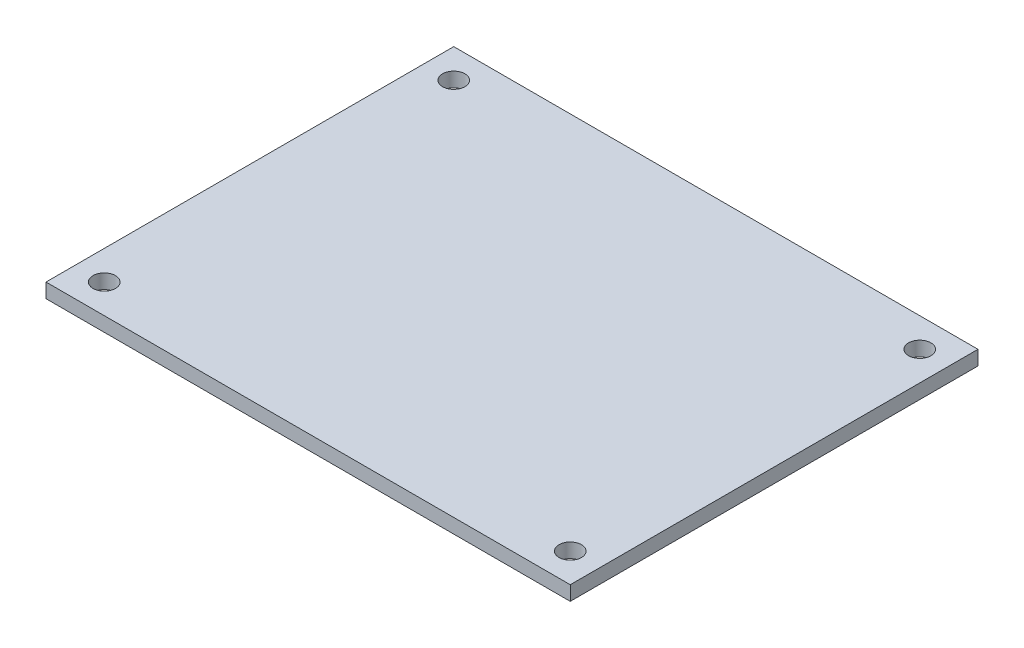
ISO-10303-21;
HEADER;
FILE_DESCRIPTION(('STEP AP214'),'2;1');
FILE_NAME('part.step','',(''),(''),'','','');
FILE_SCHEMA(('AUTOMOTIVE_DESIGN { 1 0 10303 214 1 1 1 1 }'));
ENDSEC;
DATA;
#1=APPLICATION_CONTEXT('core data for automotive mechanical design processes');
#2=APPLICATION_PROTOCOL_DEFINITION('international standard','automotive_design',2000,#1);
#3=PRODUCT_CONTEXT('',#1,'mechanical');
#4=PRODUCT('Part','Part','',(#3));
#5=PRODUCT_RELATED_PRODUCT_CATEGORY('part','',(#4));
#6=PRODUCT_DEFINITION_FORMATION('','',#4);
#7=PRODUCT_DEFINITION_CONTEXT('part definition',#1,'design');
#8=PRODUCT_DEFINITION('design','',#6,#7);
#9=PRODUCT_DEFINITION_SHAPE('','',#8);
#10=(LENGTH_UNIT() NAMED_UNIT(*) SI_UNIT(.MILLI.,.METRE.));
#11=(NAMED_UNIT(*) PLANE_ANGLE_UNIT() SI_UNIT($,.RADIAN.));
#12=(NAMED_UNIT(*) SI_UNIT($,.STERADIAN.) SOLID_ANGLE_UNIT());
#13=UNCERTAINTY_MEASURE_WITH_UNIT(LENGTH_MEASURE(1.E-05),#10,'distance_accuracy_value','');
#14=(GEOMETRIC_REPRESENTATION_CONTEXT(3) GLOBAL_UNCERTAINTY_ASSIGNED_CONTEXT((#13)) GLOBAL_UNIT_ASSIGNED_CONTEXT((#10,
#11,#12)) REPRESENTATION_CONTEXT('',''));
#15=CARTESIAN_POINT('',(0.,0.,0.));
#16=DIRECTION('',(0.,0.,1.));
#17=DIRECTION('',(1.,0.,0.));
#18=AXIS2_PLACEMENT_3D('',#15,#16,#17);
#19=CARTESIAN_POINT('',(0.,1.5748,0.));
#20=DIRECTION('',(0.,-1.,0.));
#21=DIRECTION('',(0.,0.,-1.));
#22=AXIS2_PLACEMENT_3D('',#19,#20,#21);
#23=PLANE('',#22);
#24=DIRECTION('',(0.,0.,1.));
#25=VECTOR('',#24,1.);
#26=CARTESIAN_POINT('',(0.,1.5748,0.));
#27=LINE('',#26,#25);
#28=CARTESIAN_POINT('',(0.,1.5748,-44.45));
#29=VERTEX_POINT('',#28);
#30=CARTESIAN_POINT('',(0.,1.5748,0.));
#31=VERTEX_POINT('',#30);
#32=EDGE_CURVE('E91',#29,#31,#27,.T.);
#33=ORIENTED_EDGE('',*,*,#32,.T.);
#34=DIRECTION('',(1.,0.,0.));
#35=VECTOR('',#34,1.);
#36=CARTESIAN_POINT('',(0.,1.5748,0.));
#37=LINE('',#36,#35);
#38=CARTESIAN_POINT('',(57.15,1.5748,0.));
#39=VERTEX_POINT('',#38);
#40=EDGE_CURVE('E86',#31,#39,#37,.T.);
#41=ORIENTED_EDGE('',*,*,#40,.T.);
#42=DIRECTION('',(0.,0.,-1.));
#43=VECTOR('',#42,1.);
#44=CARTESIAN_POINT('',(57.15,1.5748,0.));
#45=LINE('',#44,#43);
#46=CARTESIAN_POINT('',(57.15,1.5748,-44.45));
#47=VERTEX_POINT('',#46);
#48=EDGE_CURVE('E89',#39,#47,#45,.T.);
#49=ORIENTED_EDGE('',*,*,#48,.T.);
#50=DIRECTION('',(-1.,0.,0.));
#51=VECTOR('',#50,1.);
#52=CARTESIAN_POINT('',(0.,1.5748,-44.45));
#53=LINE('',#52,#51);
#54=EDGE_CURVE('E56',#47,#29,#53,.T.);
#55=ORIENTED_EDGE('',*,*,#54,.T.);
#56=EDGE_LOOP('',(#33,#41,#49,#55));
#57=FACE_BOUND('',#56,.T.);
#58=CARTESIAN_POINT('',(53.975,1.5748,-3.175));
#59=DIRECTION('',(0.,1.,0.));
#60=DIRECTION('',(0.,0.,1.));
#61=AXIS2_PLACEMENT_3D('',#58,#59,#60);
#62=CIRCLE('',#61,1.2192);
#63=CARTESIAN_POINT('',(53.975,1.5748,-1.9558));
#64=VERTEX_POINT('',#63);
#65=EDGE_CURVE('E106',#64,#64,#62,.T.);
#66=ORIENTED_EDGE('',*,*,#65,.F.);
#67=EDGE_LOOP('',(#66));
#68=FACE_BOUND('',#67,.T.);
#69=CARTESIAN_POINT('',(3.175,1.5748,-3.175));
#70=DIRECTION('',(0.,1.,0.));
#71=DIRECTION('',(0.,0.,1.));
#72=AXIS2_PLACEMENT_3D('',#69,#70,#71);
#73=CIRCLE('',#72,1.2192);
#74=CARTESIAN_POINT('',(3.175,1.5748,-1.9558));
#75=VERTEX_POINT('',#74);
#76=EDGE_CURVE('E121',#75,#75,#73,.T.);
#77=ORIENTED_EDGE('',*,*,#76,.F.);
#78=EDGE_LOOP('',(#77));
#79=FACE_BOUND('',#78,.T.);
#80=CARTESIAN_POINT('',(3.175,1.5748,-41.275));
#81=DIRECTION('',(0.,1.,0.));
#82=DIRECTION('',(0.,0.,1.));
#83=AXIS2_PLACEMENT_3D('',#80,#81,#82);
#84=CIRCLE('',#83,1.2192);
#85=CARTESIAN_POINT('',(3.175,1.5748,-40.0558));
#86=VERTEX_POINT('',#85);
#87=EDGE_CURVE('E127',#86,#86,#84,.T.);
#88=ORIENTED_EDGE('',*,*,#87,.F.);
#89=EDGE_LOOP('',(#88));
#90=FACE_BOUND('',#89,.T.);
#91=CARTESIAN_POINT('',(53.975,1.5748,-41.275));
#92=DIRECTION('',(0.,1.,0.));
#93=DIRECTION('',(0.,0.,1.));
#94=AXIS2_PLACEMENT_3D('',#91,#92,#93);
#95=CIRCLE('',#94,1.2192);
#96=CARTESIAN_POINT('',(53.975,1.5748,-40.0558));
#97=VERTEX_POINT('',#96);
#98=EDGE_CURVE('E133',#97,#97,#95,.T.);
#99=ORIENTED_EDGE('',*,*,#98,.F.);
#100=EDGE_LOOP('',(#99));
#101=FACE_BOUND('',#100,.T.);
#102=ADVANCED_FACE('F39',(#57,#68,#79,#90,#101),#23,.F.);
#103=CARTESIAN_POINT('',(0.,0.,0.));
#104=DIRECTION('',(0.,-1.,0.));
#105=DIRECTION('',(0.,0.,-1.));
#106=AXIS2_PLACEMENT_3D('',#103,#104,#105);
#107=PLANE('',#106);
#108=CARTESIAN_POINT('',(3.175,0.,-41.275));
#109=DIRECTION('',(0.,1.,0.));
#110=DIRECTION('',(0.,0.,1.));
#111=AXIS2_PLACEMENT_3D('',#108,#109,#110);
#112=CIRCLE('',#111,1.2192);
#113=CARTESIAN_POINT('',(3.175,0.,-40.0558));
#114=VERTEX_POINT('',#113);
#115=EDGE_CURVE('E130',#114,#114,#112,.T.);
#116=ORIENTED_EDGE('',*,*,#115,.T.);
#117=EDGE_LOOP('',(#116));
#118=FACE_BOUND('',#117,.T.);
#119=CARTESIAN_POINT('',(53.975,0.,-3.175));
#120=DIRECTION('',(0.,1.,0.));
#121=DIRECTION('',(0.,0.,1.));
#122=AXIS2_PLACEMENT_3D('',#119,#120,#121);
#123=CIRCLE('',#122,1.2192);
#124=CARTESIAN_POINT('',(53.975,0.,-1.9558));
#125=VERTEX_POINT('',#124);
#126=EDGE_CURVE('E118',#125,#125,#123,.T.);
#127=ORIENTED_EDGE('',*,*,#126,.T.);
#128=EDGE_LOOP('',(#127));
#129=FACE_BOUND('',#128,.T.);
#130=DIRECTION('',(0.,0.,1.));
#131=VECTOR('',#130,1.);
#132=CARTESIAN_POINT('',(0.,0.,0.));
#133=LINE('',#132,#131);
#134=CARTESIAN_POINT('',(0.,0.,-44.45));
#135=VERTEX_POINT('',#134);
#136=CARTESIAN_POINT('',(0.,0.,0.));
#137=VERTEX_POINT('',#136);
#138=EDGE_CURVE('E103',#135,#137,#133,.T.);
#139=ORIENTED_EDGE('',*,*,#138,.F.);
#140=DIRECTION('',(-1.,0.,0.));
#141=VECTOR('',#140,1.);
#142=CARTESIAN_POINT('',(0.,0.,-44.45));
#143=LINE('',#142,#141);
#144=CARTESIAN_POINT('',(57.15,0.,-44.45));
#145=VERTEX_POINT('',#144);
#146=EDGE_CURVE('E79',#145,#135,#143,.T.);
#147=ORIENTED_EDGE('',*,*,#146,.F.);
#148=DIRECTION('',(0.,0.,-1.));
#149=VECTOR('',#148,1.);
#150=CARTESIAN_POINT('',(57.15,0.,0.));
#151=LINE('',#150,#149);
#152=CARTESIAN_POINT('',(57.15,0.,0.));
#153=VERTEX_POINT('',#152);
#154=EDGE_CURVE('E73',#153,#145,#151,.T.);
#155=ORIENTED_EDGE('',*,*,#154,.F.);
#156=DIRECTION('',(1.,0.,0.));
#157=VECTOR('',#156,1.);
#158=CARTESIAN_POINT('',(0.,0.,0.));
#159=LINE('',#158,#157);
#160=EDGE_CURVE('E95',#137,#153,#159,.T.);
#161=ORIENTED_EDGE('',*,*,#160,.F.);
#162=EDGE_LOOP('',(#139,#147,#155,#161));
#163=FACE_BOUND('',#162,.T.);
#164=CARTESIAN_POINT('',(3.175,0.,-3.175));
#165=DIRECTION('',(0.,1.,0.));
#166=DIRECTION('',(0.,0.,1.));
#167=AXIS2_PLACEMENT_3D('',#164,#165,#166);
#168=CIRCLE('',#167,1.2192);
#169=CARTESIAN_POINT('',(3.175,0.,-1.9558));
#170=VERTEX_POINT('',#169);
#171=EDGE_CURVE('E124',#170,#170,#168,.T.);
#172=ORIENTED_EDGE('',*,*,#171,.T.);
#173=EDGE_LOOP('',(#172));
#174=FACE_BOUND('',#173,.T.);
#175=CARTESIAN_POINT('',(53.975,0.,-41.275));
#176=DIRECTION('',(0.,1.,0.));
#177=DIRECTION('',(0.,0.,1.));
#178=AXIS2_PLACEMENT_3D('',#175,#176,#177);
#179=CIRCLE('',#178,1.2192);
#180=CARTESIAN_POINT('',(53.975,0.,-40.0558));
#181=VERTEX_POINT('',#180);
#182=EDGE_CURVE('E136',#181,#181,#179,.T.);
#183=ORIENTED_EDGE('',*,*,#182,.T.);
#184=EDGE_LOOP('',(#183));
#185=FACE_BOUND('',#184,.T.);
#186=ADVANCED_FACE('F114',(#118,#129,#163,#174,#185),#107,.T.);
#187=CARTESIAN_POINT('',(0.,1.5748,0.));
#188=DIRECTION('',(1.,0.,0.));
#189=DIRECTION('',(0.,0.,-1.));
#190=AXIS2_PLACEMENT_3D('',#187,#188,#189);
#191=PLANE('',#190);
#192=ORIENTED_EDGE('',*,*,#138,.T.);
#193=DIRECTION('',(0.,-1.,0.));
#194=VECTOR('',#193,1.);
#195=CARTESIAN_POINT('',(0.,1.5748,0.));
#196=LINE('',#195,#194);
#197=EDGE_CURVE('E11',#31,#137,#196,.T.);
#198=ORIENTED_EDGE('',*,*,#197,.F.);
#199=ORIENTED_EDGE('',*,*,#32,.F.);
#200=DIRECTION('',(0.,-1.,0.));
#201=VECTOR('',#200,1.);
#202=CARTESIAN_POINT('',(0.,1.5748,-44.45));
#203=LINE('',#202,#201);
#204=EDGE_CURVE('E99',#29,#135,#203,.T.);
#205=ORIENTED_EDGE('',*,*,#204,.T.);
#206=EDGE_LOOP('',(#192,#198,#199,#205));
#207=FACE_BOUND('',#206,.T.);
#208=ADVANCED_FACE('F41',(#207),#191,.F.);
#209=CARTESIAN_POINT('',(0.,1.5748,0.));
#210=DIRECTION('',(0.,0.,-1.));
#211=DIRECTION('',(-1.,0.,0.));
#212=AXIS2_PLACEMENT_3D('',#209,#210,#211);
#213=PLANE('',#212);
#214=ORIENTED_EDGE('',*,*,#160,.T.);
#215=DIRECTION('',(0.,-1.,0.));
#216=VECTOR('',#215,1.);
#217=CARTESIAN_POINT('',(57.15,1.5748,0.));
#218=LINE('',#217,#216);
#219=EDGE_CURVE('E48',#39,#153,#218,.T.);
#220=ORIENTED_EDGE('',*,*,#219,.F.);
#221=ORIENTED_EDGE('',*,*,#40,.F.);
#222=ORIENTED_EDGE('',*,*,#197,.T.);
#223=EDGE_LOOP('',(#214,#220,#221,#222));
#224=FACE_BOUND('',#223,.T.);
#225=ADVANCED_FACE('F94',(#224),#213,.F.);
#226=CARTESIAN_POINT('',(57.15,1.5748,0.));
#227=DIRECTION('',(-1.,0.,0.));
#228=DIRECTION('',(0.,0.,1.));
#229=AXIS2_PLACEMENT_3D('',#226,#227,#228);
#230=PLANE('',#229);
#231=ORIENTED_EDGE('',*,*,#154,.T.);
#232=DIRECTION('',(0.,-1.,0.));
#233=VECTOR('',#232,1.);
#234=CARTESIAN_POINT('',(57.15,1.5748,-44.45));
#235=LINE('',#234,#233);
#236=EDGE_CURVE('E96',#47,#145,#235,.T.);
#237=ORIENTED_EDGE('',*,*,#236,.F.);
#238=ORIENTED_EDGE('',*,*,#48,.F.);
#239=ORIENTED_EDGE('',*,*,#219,.T.);
#240=EDGE_LOOP('',(#231,#237,#238,#239));
#241=FACE_BOUND('',#240,.T.);
#242=ADVANCED_FACE('F97',(#241),#230,.F.);
#243=CARTESIAN_POINT('',(0.,1.5748,-44.45));
#244=DIRECTION('',(0.,0.,1.));
#245=DIRECTION('',(1.,0.,0.));
#246=AXIS2_PLACEMENT_3D('',#243,#244,#245);
#247=PLANE('',#246);
#248=ORIENTED_EDGE('',*,*,#146,.T.);
#249=ORIENTED_EDGE('',*,*,#204,.F.);
#250=ORIENTED_EDGE('',*,*,#54,.F.);
#251=ORIENTED_EDGE('',*,*,#236,.T.);
#252=EDGE_LOOP('',(#248,#249,#250,#251));
#253=FACE_BOUND('',#252,.T.);
#254=ADVANCED_FACE('F111',(#253),#247,.F.);
#255=CARTESIAN_POINT('',(53.975,1.5748,-3.175));
#256=DIRECTION('',(0.,-1.,0.));
#257=DIRECTION('',(0.,0.,-1.));
#258=AXIS2_PLACEMENT_3D('',#255,#256,#257);
#259=CYLINDRICAL_SURFACE('',#258,1.2192);
#260=ORIENTED_EDGE('',*,*,#65,.T.);
#261=EDGE_LOOP('',(#260));
#262=FACE_BOUND('',#261,.T.);
#263=ORIENTED_EDGE('',*,*,#126,.F.);
#264=EDGE_LOOP('',(#263));
#265=FACE_BOUND('',#264,.T.);
#266=ADVANCED_FACE('F153',(#262,#265),#259,.F.);
#267=CARTESIAN_POINT('',(3.175,1.5748,-3.175));
#268=DIRECTION('',(0.,-1.,0.));
#269=DIRECTION('',(0.,0.,-1.));
#270=AXIS2_PLACEMENT_3D('',#267,#268,#269);
#271=CYLINDRICAL_SURFACE('',#270,1.2192);
#272=ORIENTED_EDGE('',*,*,#76,.T.);
#273=EDGE_LOOP('',(#272));
#274=FACE_BOUND('',#273,.T.);
#275=ORIENTED_EDGE('',*,*,#171,.F.);
#276=EDGE_LOOP('',(#275));
#277=FACE_BOUND('',#276,.T.);
#278=ADVANCED_FACE('F198',(#274,#277),#271,.F.);
#279=CARTESIAN_POINT('',(3.175,1.5748,-41.275));
#280=DIRECTION('',(0.,-1.,0.));
#281=DIRECTION('',(0.,0.,-1.));
#282=AXIS2_PLACEMENT_3D('',#279,#280,#281);
#283=CYLINDRICAL_SURFACE('',#282,1.2192);
#284=ORIENTED_EDGE('',*,*,#87,.T.);
#285=EDGE_LOOP('',(#284));
#286=FACE_BOUND('',#285,.T.);
#287=ORIENTED_EDGE('',*,*,#115,.F.);
#288=EDGE_LOOP('',(#287));
#289=FACE_BOUND('',#288,.T.);
#290=ADVANCED_FACE('F206',(#286,#289),#283,.F.);
#291=CARTESIAN_POINT('',(53.975,1.5748,-41.275));
#292=DIRECTION('',(0.,-1.,0.));
#293=DIRECTION('',(0.,0.,-1.));
#294=AXIS2_PLACEMENT_3D('',#291,#292,#293);
#295=CYLINDRICAL_SURFACE('',#294,1.2192);
#296=ORIENTED_EDGE('',*,*,#98,.T.);
#297=EDGE_LOOP('',(#296));
#298=FACE_BOUND('',#297,.T.);
#299=ORIENTED_EDGE('',*,*,#182,.F.);
#300=EDGE_LOOP('',(#299));
#301=FACE_BOUND('',#300,.T.);
#302=ADVANCED_FACE('F142',(#298,#301),#295,.F.);
#303=CLOSED_SHELL('',(#102,#186,#208,#225,#242,#254,#266,#278,#290,#302));
#304=MANIFOLD_SOLID_BREP('B2',#303);
#305=ADVANCED_BREP_SHAPE_REPRESENTATION('',(#18,#304),#14);
#306=SHAPE_DEFINITION_REPRESENTATION(#9,#305);
ENDSEC;
END-ISO-10303-21;
